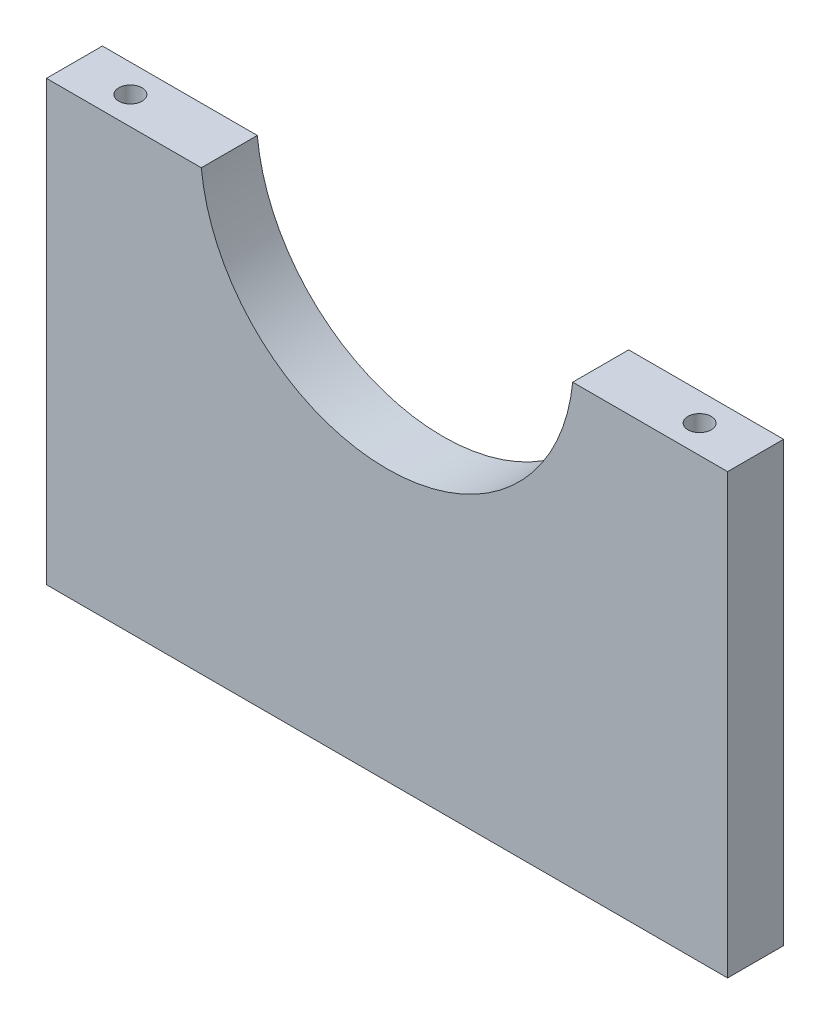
from build123d import *

# Parameters (mm, degrees)
BOSS_EXTRUDE1_DEPTH       = 12
M6X1_0_TAPPED_HOLE1_D     = 5
M6X1_0_TAPPED_HOLE1_DEPTH = 20.997848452
M6X1_0_TAPPED_HOLE1_TIP   = 1.502151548
M8X1_0_TAPPED_HOLE1_D     = 7
M8X1_0_TAPPED_HOLE1_DEPTH = 26
M8X1_0_TAPPED_HOLE1_TIP   = 2.103012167


with BuildPart() as part:
    # Sketch1 → Boss-Extrude1 (new body)
    with BuildSketch(Plane.XY):
        with BuildLine():
            Line((39.799497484, 47), (73, 47))
            Line((73, 47), (73, -47))
            Line((73, -47), (-73, -47))
            Line((-73, -47), (-73, 47))
            Line((-73, 47), (-39.799497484, 47))
            ThreePointArc((-39.799497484, 47), (0, 11), (39.799497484, 47))
        make_face()
    extrude(amount=BOSS_EXTRUDE1_DEPTH)

    # M6x1.0 Tapped Hole1
    with Locations(Plane(origin=(-61, 47, 6), x_dir=(0, 0, 1), z_dir=(0, 1, 0))):
        with Locations((0, 0), (0, 122)):
            Hole(M6X1_0_TAPPED_HOLE1_D / 2, depth=M6X1_0_TAPPED_HOLE1_DEPTH)
            with Locations((0, 0, -(M6X1_0_TAPPED_HOLE1_DEPTH + M6X1_0_TAPPED_HOLE1_TIP / 2))):  # 118° drill point
                Cone(0, M6X1_0_TAPPED_HOLE1_D / 2, M6X1_0_TAPPED_HOLE1_TIP, mode=Mode.SUBTRACT)

    # M8x1.0 Tapped Hole1
    with Locations(Plane(origin=(-61, -47, 6), x_dir=(0, 0, -1), z_dir=(0, -1, 0))):
        with Locations((0, 0), (0, 122)):
            Hole(M8X1_0_TAPPED_HOLE1_D / 2, depth=M8X1_0_TAPPED_HOLE1_DEPTH)
            with Locations((0, 0, -(M8X1_0_TAPPED_HOLE1_DEPTH + M8X1_0_TAPPED_HOLE1_TIP / 2))):  # 118° drill point
                Cone(0, M8X1_0_TAPPED_HOLE1_D / 2, M8X1_0_TAPPED_HOLE1_TIP, mode=Mode.SUBTRACT)


solid = part.part
